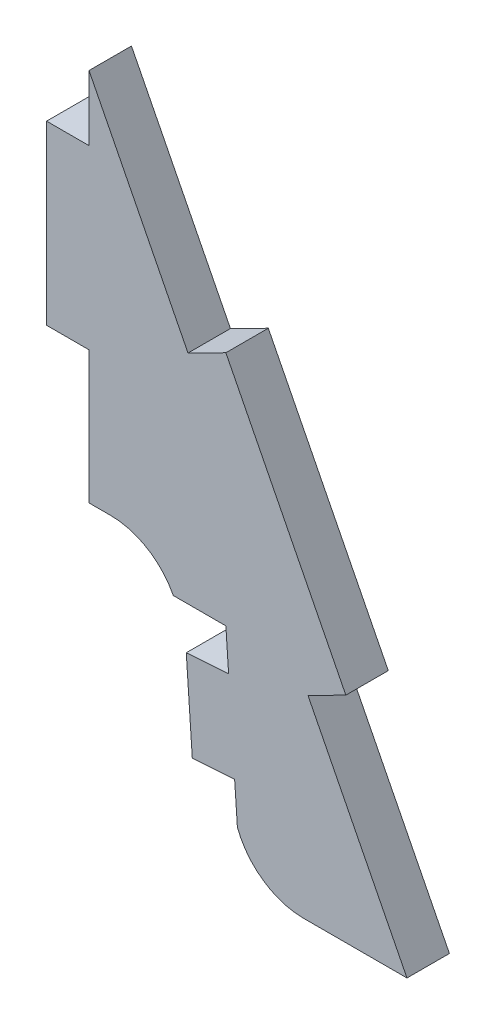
from build123d import *

# Parameters (mm, degrees)
BOSS_EXTRUDE1_DEPTH = 1.524


with BuildPart() as part:
    # Sketch1 → Boss-Extrude1 (new body)
    with BuildSketch(Plane.XY):
        with BuildLine():
            Line((1.524, -263.869146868), (0, -263.869146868))
            Line((0, -263.869146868), (0, -257.519146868))
            Line((0, -257.519146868), (1.524, -257.519146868))
            Line((1.524, -257.519146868), (1.524, -255.182661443))
            Line((1.524, -255.182661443), (5.07892177, -262.192003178))
            Line((5.07892177, -262.192003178), (6.438108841, -261.502665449))
            Line((6.438108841, -261.502665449), (10.746469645, -269.997584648))
            Line((10.746469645, -269.997584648), (9.387282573, -270.686922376))
            Line((9.387282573, -270.686922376), (12.942204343, -277.696264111))
            Line((12.942204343, -277.696264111), (9.228712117, -277.696264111))
            ThreePointArc((9.228712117, -277.696264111), (7.78331732, -277.244908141), (6.851613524, -276.051251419))
            Line((6.851613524, -276.051251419), (6.753045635, -274.608227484))
            Line((6.753045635, -274.608227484), (5.232588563, -274.712084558))
            Line((5.232588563, -274.712084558), (5.016219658, -271.544465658))
            Line((5.016219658, -271.544465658), (6.536676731, -271.440608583))
            Line((6.536676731, -271.440608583), (6.438108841, -269.997584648))
            Line((6.438108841, -269.997584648), (4.552729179, -269.997584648))
            ThreePointArc((4.552729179, -269.997584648), (3.617453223, -268.999813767), (2.300357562, -268.631646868))
            Line((2.300357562, -268.631646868), (1.524, -268.631646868))
            Line((1.524, -268.631646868), (1.524, -263.869146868))
        make_face()
    extrude(amount=BOSS_EXTRUDE1_DEPTH)


solid = part.part
